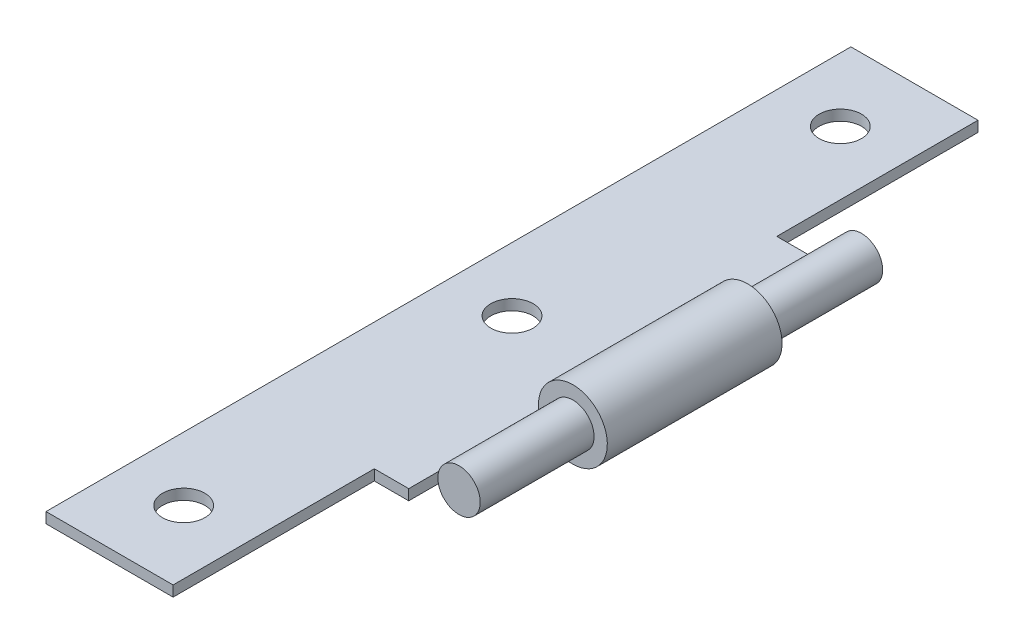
from build123d import *

# Parameters (mm, degrees)
SKETCH_1_R                  = 3.25
EXTRUDE_1_DEPTH             = 38
EXTRUDE_2_REACH             = 40.277
SKETCH_2_W                  = 20
SKETCH_2_H                  = 1
EXTRUDE_2_DIRECTION_2_REACH = 40.277
CUT_EXTRUDE_3_DEPTH         = 44.430979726
SKETCH_8_R                  = 2
EXTRUDE_3_DEPTH             = 10.75
HOLE_WIZARD_4_0_4_1_D       = 4


with BuildPart() as part:
    # Sketch 1 → Extrude 1 (new, symmetric)
    with BuildSketch(Plane.XY):
        Circle(SKETCH_1_R)
    extrude(amount=EXTRUDE_1_DEPTH, both=True)

    # Extrude 2: up to this face of the body (flat: up to its plane)
    extrude_2_end = Plane(part.part.faces().sort_by_distance((0, 0, 38))[0])
    # Sketch 2 → Extrude 2 (add, up to the picked face)
    with BuildSketch(Plane.XY, mode=Mode.PRIVATE) as extrude_2_sk1:
        with Locations((-10, -2.75)):
            Rectangle(SKETCH_2_W, SKETCH_2_H)
    extrude_2_tool1 = split(extrude(extrude_2_sk1.sketch, amount=EXTRUDE_2_REACH, mode=Mode.PRIVATE), bisect_by=extrude_2_end, keep=Keep.BOTH, mode=Mode.PRIVATE)
    add(extrude_2_tool1.solids().sort_by(Axis((-10, -2.75, 0), (0, 0, 1)))[0])

    # Extrude 2 direction 2: up to this face of the body (flat: up to its plane)
    extrude_2_direction_2_end = Plane(part.part.faces().sort_by_distance((0, 0, -38))[0])
    # Sketch 2 → Extrude 2 direction 2 (add, up to the picked face)
    with BuildSketch(Plane.XY, mode=Mode.PRIVATE) as extrude_2_direction_2_sk1:
        with Locations((-10, -2.75)):
            Rectangle(SKETCH_2_W, SKETCH_2_H)
    extrude_2_direction_2_tool1 = split(extrude(extrude_2_direction_2_sk1.sketch, amount=-EXTRUDE_2_DIRECTION_2_REACH, mode=Mode.PRIVATE), bisect_by=extrude_2_direction_2_end, keep=Keep.BOTH, mode=Mode.PRIVATE)
    add(extrude_2_direction_2_tool1.solids().sort_by(Axis((-10, -2.75, 0), (0, 0, -1)))[0])

    # Sketch 5 → Cut-Extrude 3 (cut, through all)
    with BuildSketch(Plane.XZ.offset(3.25)):
        Polygon((-8, -38), (3.25, -38), (3.25, -8.25), (-4.75, -8.25), (-4.75, -19), (-8, -19), align=None)
        Polygon((-4.75, 8.25), (3.25, 8.25), (3.25, 38), (-8, 38), (-8, 19), (-4.75, 19), align=None)
    extrude(amount=-CUT_EXTRUDE_3_DEPTH, mode=Mode.SUBTRACT)

    # Sketch 8 → Extrude 3 (add)
    with BuildSketch(Plane.XY.offset(8.25)):
        with Locations(Location((0, 0, 0), (0, 0, 180))):
            Circle(SKETCH_8_R)
    extrude_3 = extrude(amount=EXTRUDE_3_DEPTH)

    # Mirror 1: Extrude 3 across plane
    add(extrude_3.mirror(Plane.XY))

    # Hole Wizard 4.0 _4_ _1 (through all)
    with Locations(Plane(origin=(0, -2.25, 0), x_dir=(-1, 0, 0), z_dir=(0, 1, 0))):
        with Locations((14, -31), (14, 0), (14, 31)):
            Hole(HOLE_WIZARD_4_0_4_1_D / 2)


solid = part.part
